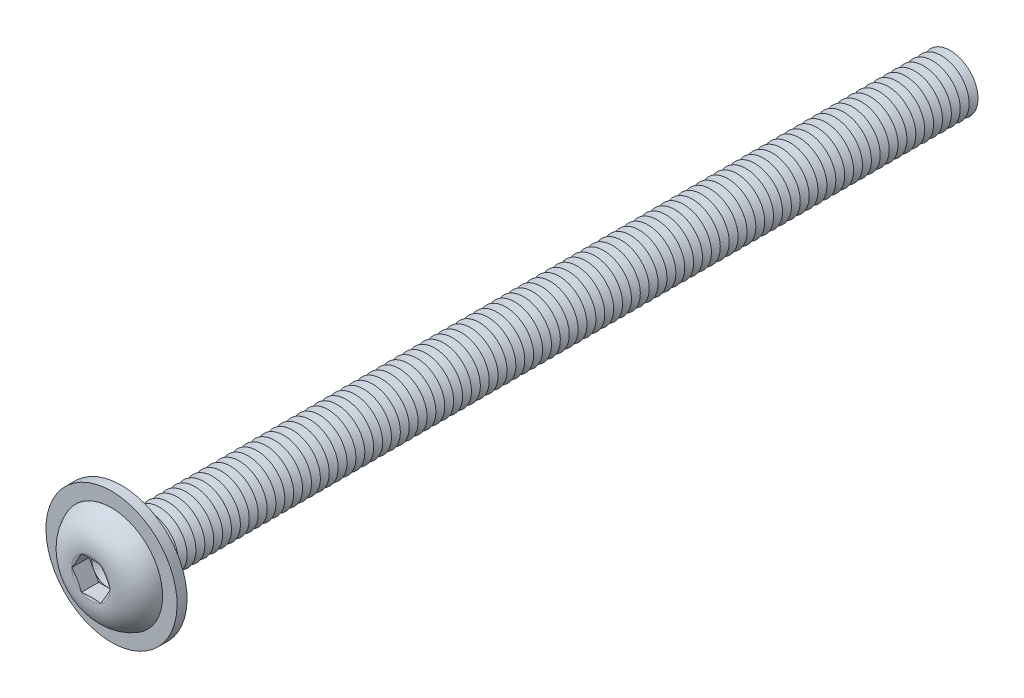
from build123d import *

# Parameters (mm, degrees)
FILLET1_R           = 0.4
LPATTERN1_COUNT     = 93
LPATTERN1_PITCH     = 0.8
CUT_EXTRUDE1_DEPTH  = 1.56
SKETCH5_R           = 5.9
SKETCH5_R_2         = 2.9
BOSS_EXTRUDE1_DEPTH = 0.9


with BuildPart() as part:
    # Sketch1 → Revolve1 (revolve)
    with BuildSketch(Plane(origin=(0, 0, 0), x_dir=(0, 0, -1), z_dir=(1, 0, 0))):
        with BuildLine():
            Line((0, 2.5), (0, 4.75))
            ThreePointArc((0, 4.75), (-2.041477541, 3.848329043), (-2.75, 1.73205))
            Line((-2.75, 1.73205), (-2.517949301, 0.866025))
            Line((-2.517949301, 0.866025), (-2.75, 0.866025))
            Line((-2.75, 0.866025), (-2.75, 0))
            Line((-2.75, 0), (75, 0))
            Line((75, 0), (75, 2.5))
            Line((75, 2.5), (0, 2.5))
        make_face()
    revolve(axis=Axis((0, 0, -75), (0, 0, 1)))

    # Fillet1
    fillet1_edges = [part.edges().sort_by_distance(p)[0] for p in [
        (0, -2.5, 0),
    ]]
    fillet(fillet1_edges, radius=FILLET1_R)

    # Sketch2 → Cut-Revolve1 (revolve, cut)
    with BuildSketch(Plane(origin=(0, 0, 0), x_dir=(0, 0, -1), z_dir=(1, 0, 0))):
        Polygon((74.6, 2.5), (75.4, 2.5), (75, 1.807179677), align=None)
    cut_revolve1 = revolve(axis=Axis((0, 0, -75), (0, 0, -1)), mode=Mode.SUBTRACT)

    # LPattern1: Cut-Revolve1 ×93
    with Locations(*[(0, 0, i * LPATTERN1_PITCH) for i in range(1, LPATTERN1_COUNT)]):
        add(cut_revolve1, mode=Mode.SUBTRACT)

    # Sketch3 → Cut-Extrude1 (cut)
    with BuildSketch(Plane.XY.offset(2.75)):
        Polygon((0.866025, 1.499999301), (-0.866025, 1.499999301), (-1.73205, 0), (-0.866025, -1.499999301), (0.866025, -1.499999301), (1.73205, 0), align=None)
    extrude(amount=-CUT_EXTRUDE1_DEPTH, mode=Mode.SUBTRACT)

    # Cut-Extrude2 cone 1 section (on through the dimple's axis) → Cut-Extrude2 (revolve, cut)
    with BuildSketch(Plane(origin=(0, 0, 1.19), x_dir=(0, -1, 0), z_dir=(1, 0, 0))):
        Polygon((0, 0), (1.499999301, 0), (0, 0.866025), align=None)
    revolve(axis=Axis((0, 0, 1.19), (0, 0, -1)), mode=Mode.SUBTRACT)

    # Sketch5 → Boss-Extrude1 (add)
    with BuildSketch(Plane(origin=(0, 0, 0), x_dir=(-1, 0, 0), z_dir=(0, 0, -1))):
        with Locations(Location((0, 0, 0), (0, 0, 90))):
            Circle(SKETCH5_R)
        Circle(SKETCH5_R_2, mode=Mode.SUBTRACT)
    extrude(amount=-BOSS_EXTRUDE1_DEPTH)


solid = part.part
